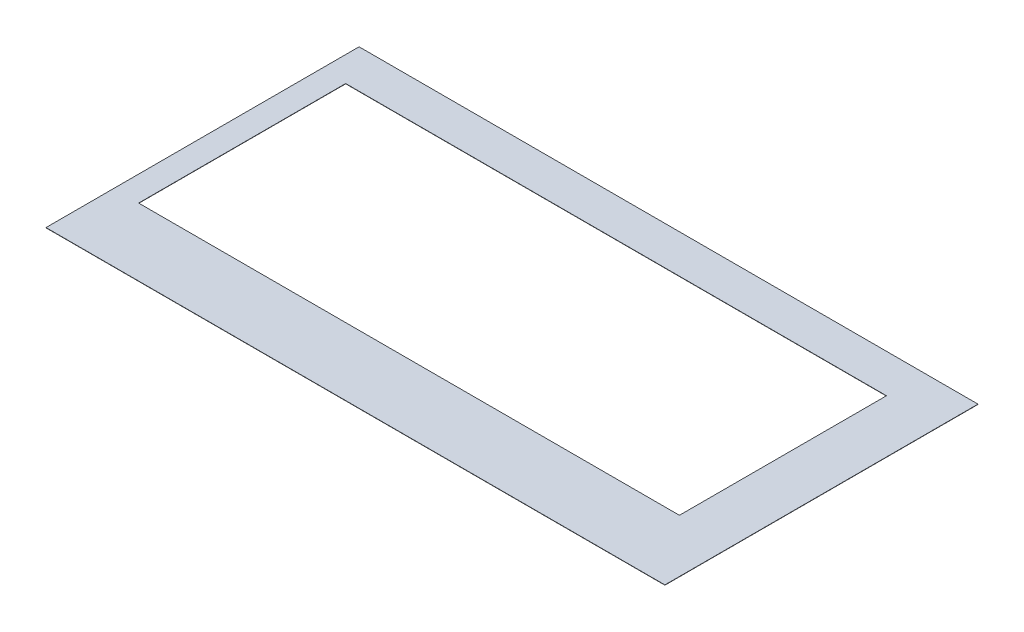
from build123d import *

# Parameters (mm, degrees)
SKETCH1_W           = 96.9
SKETCH1_H           = 37.1
BOSS_EXTRUDE1_DEPTH = 0.05


with BuildPart() as part:
    # Sketch1 → Boss-Extrude1 (new body)
    with BuildSketch(Plane(origin=(0, 0, 0), x_dir=(1, 0, 0), z_dir=(0, 1, 0))):
        Polygon((0, 0), (109.5, 0), (109.5, 56.1), (0, 56.1), (-1.4, 56.1), (-1.4, 0), align=None)
        with Locations((51.55, 30.65)):
            Rectangle(SKETCH1_W, SKETCH1_H, mode=Mode.SUBTRACT)
    extrude(amount=BOSS_EXTRUDE1_DEPTH)


solid = part.part
